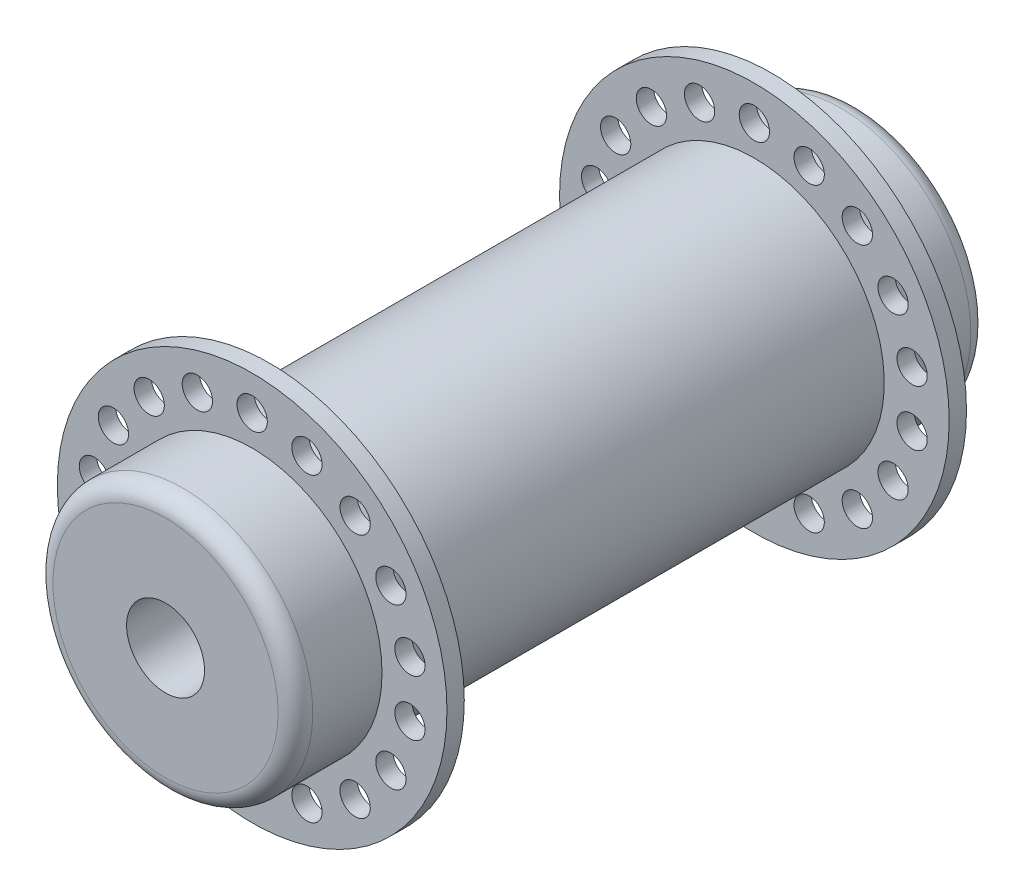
ISO-10303-21;
HEADER;
FILE_DESCRIPTION(('STEP AP214'),'2;1');
FILE_NAME('part.step','',(''),(''),'','','');
FILE_SCHEMA(('AUTOMOTIVE_DESIGN { 1 0 10303 214 1 1 1 1 }'));
ENDSEC;
DATA;
#1=APPLICATION_CONTEXT('core data for automotive mechanical design processes');
#2=APPLICATION_PROTOCOL_DEFINITION('international standard','automotive_design',2000,#1);
#3=PRODUCT_CONTEXT('',#1,'mechanical');
#4=PRODUCT('Part','Part','',(#3));
#5=PRODUCT_RELATED_PRODUCT_CATEGORY('part','',(#4));
#6=PRODUCT_DEFINITION_FORMATION('','',#4);
#7=PRODUCT_DEFINITION_CONTEXT('part definition',#1,'design');
#8=PRODUCT_DEFINITION('design','',#6,#7);
#9=PRODUCT_DEFINITION_SHAPE('','',#8);
#10=(LENGTH_UNIT() NAMED_UNIT(*) SI_UNIT(.MILLI.,.METRE.));
#11=(NAMED_UNIT(*) PLANE_ANGLE_UNIT() SI_UNIT($,.RADIAN.));
#12=(NAMED_UNIT(*) SI_UNIT($,.STERADIAN.) SOLID_ANGLE_UNIT());
#13=UNCERTAINTY_MEASURE_WITH_UNIT(LENGTH_MEASURE(1.E-05),#10,'distance_accuracy_value','');
#14=(GEOMETRIC_REPRESENTATION_CONTEXT(3) GLOBAL_UNCERTAINTY_ASSIGNED_CONTEXT((#13)) GLOBAL_UNIT_ASSIGNED_CONTEXT((#10,
#11,#12)) REPRESENTATION_CONTEXT('',''));
#15=CARTESIAN_POINT('',(0.,0.,0.));
#16=DIRECTION('',(0.,0.,1.));
#17=DIRECTION('',(1.,0.,0.));
#18=AXIS2_PLACEMENT_3D('',#15,#16,#17);
#19=CARTESIAN_POINT('',(0.,0.,-40.));
#20=DIRECTION('',(0.,0.,1.));
#21=DIRECTION('',(1.,0.,0.));
#22=AXIS2_PLACEMENT_3D('',#19,#20,#21);
#23=CYLINDRICAL_SURFACE('',#22,15.);
#24=CARTESIAN_POINT('',(0.,0.,-28.));
#25=DIRECTION('',(0.,0.,-1.));
#26=DIRECTION('',(-1.,0.,0.));
#27=AXIS2_PLACEMENT_3D('',#24,#25,#26);
#28=CIRCLE('',#27,15.);
#29=CARTESIAN_POINT('',(-15.,0.,-28.));
#30=VERTEX_POINT('',#29);
#31=EDGE_CURVE('E165',#30,#30,#28,.T.);
#32=ORIENTED_EDGE('',*,*,#31,.F.);
#33=EDGE_LOOP('',(#32));
#34=FACE_BOUND('',#33,.T.);
#35=CARTESIAN_POINT('',(0.,0.,28.));
#36=DIRECTION('',(0.,0.,-1.));
#37=DIRECTION('',(-1.,0.,0.));
#38=AXIS2_PLACEMENT_3D('',#35,#36,#37);
#39=CIRCLE('',#38,15.);
#40=CARTESIAN_POINT('',(-15.,0.,28.));
#41=VERTEX_POINT('',#40);
#42=EDGE_CURVE('E158',#41,#41,#39,.T.);
#43=ORIENTED_EDGE('',*,*,#42,.T.);
#44=EDGE_LOOP('',(#43));
#45=FACE_BOUND('',#44,.T.);
#46=ADVANCED_FACE('F31',(#34,#45),#23,.T.);
#47=CARTESIAN_POINT('',(0.,0.,30.));
#48=DIRECTION('',(0.,0.,1.));
#49=DIRECTION('',(1.,0.,0.));
#50=AXIS2_PLACEMENT_3D('',#47,#48,#49);
#51=CIRCLE('',#50,15.);
#52=CARTESIAN_POINT('',(15.,0.,30.));
#53=VERTEX_POINT('',#52);
#54=EDGE_CURVE('E10',#53,#53,#51,.F.);
#55=ORIENTED_EDGE('',*,*,#54,.F.);
#56=EDGE_LOOP('',(#55));
#57=FACE_BOUND('',#56,.T.);
#58=CARTESIAN_POINT('',(0.,0.,38.));
#59=DIRECTION('',(0.,0.,1.));
#60=DIRECTION('',(1.,0.,0.));
#61=AXIS2_PLACEMENT_3D('',#58,#59,#60);
#62=CIRCLE('',#61,15.);
#63=CARTESIAN_POINT('',(15.,0.,38.));
#64=VERTEX_POINT('',#63);
#65=EDGE_CURVE('E188',#64,#64,#62,.F.);
#66=ORIENTED_EDGE('',*,*,#65,.T.);
#67=EDGE_LOOP('',(#66));
#68=FACE_BOUND('',#67,.T.);
#69=ADVANCED_FACE('F211',(#57,#68),#23,.T.);
#70=CARTESIAN_POINT('',(0.,0.,-38.));
#71=DIRECTION('',(0.,0.,1.));
#72=DIRECTION('',(1.,0.,0.));
#73=AXIS2_PLACEMENT_3D('',#70,#71,#72);
#74=CIRCLE('',#73,15.);
#75=CARTESIAN_POINT('',(15.,0.,-38.));
#76=VERTEX_POINT('',#75);
#77=EDGE_CURVE('E44',#76,#76,#74,.T.);
#78=ORIENTED_EDGE('',*,*,#77,.T.);
#79=EDGE_LOOP('',(#78));
#80=FACE_BOUND('',#79,.T.);
#81=CARTESIAN_POINT('',(0.,0.,-30.));
#82=DIRECTION('',(0.,0.,-1.));
#83=DIRECTION('',(-1.,0.,0.));
#84=AXIS2_PLACEMENT_3D('',#81,#82,#83);
#85=CIRCLE('',#84,15.);
#86=CARTESIAN_POINT('',(-15.,0.,-30.));
#87=VERTEX_POINT('',#86);
#88=EDGE_CURVE('E182',#87,#87,#85,.F.);
#89=ORIENTED_EDGE('',*,*,#88,.F.);
#90=EDGE_LOOP('',(#89));
#91=FACE_BOUND('',#90,.T.);
#92=ADVANCED_FACE('F193',(#80,#91),#23,.T.);
#93=CARTESIAN_POINT('',(0.,0.,-40.));
#94=DIRECTION('',(0.,0.,1.));
#95=DIRECTION('',(1.,0.,0.));
#96=AXIS2_PLACEMENT_3D('',#93,#94,#95);
#97=PLANE('',#96);
#98=CARTESIAN_POINT('',(0.,0.,-40.));
#99=DIRECTION('',(0.,0.,1.));
#100=DIRECTION('',(1.,0.,0.));
#101=AXIS2_PLACEMENT_3D('',#98,#99,#100);
#102=CIRCLE('',#101,13.);
#103=CARTESIAN_POINT('',(13.,0.,-40.));
#104=VERTEX_POINT('',#103);
#105=EDGE_CURVE('E39',#104,#104,#102,.F.);
#106=ORIENTED_EDGE('',*,*,#105,.T.);
#107=EDGE_LOOP('',(#106));
#108=FACE_BOUND('',#107,.T.);
#109=CARTESIAN_POINT('',(0.,0.,-40.));
#110=DIRECTION('',(0.,0.,1.));
#111=DIRECTION('',(1.,0.,0.));
#112=AXIS2_PLACEMENT_3D('',#109,#110,#111);
#113=CIRCLE('',#112,4.5);
#114=CARTESIAN_POINT('',(4.5,0.,-40.));
#115=VERTEX_POINT('',#114);
#116=EDGE_CURVE('E179',#115,#115,#113,.T.);
#117=ORIENTED_EDGE('',*,*,#116,.T.);
#118=EDGE_LOOP('',(#117));
#119=FACE_BOUND('',#118,.T.);
#120=ADVANCED_FACE('F222',(#108,#119),#97,.F.);
#121=CARTESIAN_POINT('',(0.,0.,-40.));
#122=DIRECTION('',(0.,0.,1.));
#123=DIRECTION('',(1.,0.,0.));
#124=AXIS2_PLACEMENT_3D('',#121,#122,#123);
#125=CYLINDRICAL_SURFACE('',#124,4.5);
#126=ORIENTED_EDGE('',*,*,#116,.F.);
#127=EDGE_LOOP('',(#126));
#128=FACE_BOUND('',#127,.T.);
#129=CARTESIAN_POINT('',(0.,0.,40.));
#130=DIRECTION('',(0.,0.,1.));
#131=DIRECTION('',(1.,0.,0.));
#132=AXIS2_PLACEMENT_3D('',#129,#130,#131);
#133=CIRCLE('',#132,4.5);
#134=CARTESIAN_POINT('',(4.5,0.,40.));
#135=VERTEX_POINT('',#134);
#136=EDGE_CURVE('E174',#135,#135,#133,.T.);
#137=ORIENTED_EDGE('',*,*,#136,.T.);
#138=EDGE_LOOP('',(#137));
#139=FACE_BOUND('',#138,.T.);
#140=ADVANCED_FACE('F226',(#128,#139),#125,.F.);
#141=CARTESIAN_POINT('',(0.,0.,40.));
#142=DIRECTION('',(0.,0.,1.));
#143=DIRECTION('',(1.,0.,0.));
#144=AXIS2_PLACEMENT_3D('',#141,#142,#143);
#145=PLANE('',#144);
#146=CARTESIAN_POINT('',(0.,0.,40.));
#147=DIRECTION('',(0.,0.,1.));
#148=DIRECTION('',(1.,0.,0.));
#149=AXIS2_PLACEMENT_3D('',#146,#147,#148);
#150=CIRCLE('',#149,13.);
#151=CARTESIAN_POINT('',(13.,0.,40.));
#152=VERTEX_POINT('',#151);
#153=EDGE_CURVE('E185',#152,#152,#150,.T.);
#154=ORIENTED_EDGE('',*,*,#153,.T.);
#155=EDGE_LOOP('',(#154));
#156=FACE_BOUND('',#155,.T.);
#157=ORIENTED_EDGE('',*,*,#136,.F.);
#158=EDGE_LOOP('',(#157));
#159=FACE_BOUND('',#158,.T.);
#160=ADVANCED_FACE('F231',(#156,#159),#145,.T.);
#161=CARTESIAN_POINT('',(0.,0.,-30.));
#162=DIRECTION('',(0.,0.,-1.));
#163=DIRECTION('',(-1.,0.,0.));
#164=AXIS2_PLACEMENT_3D('',#161,#162,#163);
#165=PLANE('',#164);
#166=CARTESIAN_POINT('',(6.32737265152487,-17.3843134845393,-30.));
#167=DIRECTION('',(0.,0.,-1.));
#168=DIRECTION('',(-1.,0.,0.));
#169=AXIS2_PLACEMENT_3D('',#166,#167,#168);
#170=CIRCLE('',#169,1.75);
#171=CARTESIAN_POINT('',(4.57737265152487,-17.3843134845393,-30.));
#172=VERTEX_POINT('',#171);
#173=EDGE_CURVE('E155',#172,#172,#170,.T.);
#174=ORIENTED_EDGE('',*,*,#173,.F.);
#175=EDGE_LOOP('',(#174));
#176=FACE_BOUND('',#175,.T.);
#177=CARTESIAN_POINT('',(11.891570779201,-14.1718221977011,-30.));
#178=DIRECTION('',(0.,0.,-1.));
#179=DIRECTION('',(-1.,0.,0.));
#180=AXIS2_PLACEMENT_3D('',#177,#178,#179);
#181=CIRCLE('',#180,1.75);
#182=CARTESIAN_POINT('',(10.141570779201,-14.1718221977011,-30.));
#183=VERTEX_POINT('',#182);
#184=EDGE_CURVE('E146',#183,#183,#181,.T.);
#185=ORIENTED_EDGE('',*,*,#184,.F.);
#186=EDGE_LOOP('',(#185));
#187=FACE_BOUND('',#186,.T.);
#188=CARTESIAN_POINT('',(16.0214699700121,-9.25,-30.));
#189=DIRECTION('',(0.,0.,-1.));
#190=DIRECTION('',(-1.,0.,0.));
#191=AXIS2_PLACEMENT_3D('',#188,#189,#190);
#192=CIRCLE('',#191,1.75);
#193=CARTESIAN_POINT('',(14.2714699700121,-9.25,-30.));
#194=VERTEX_POINT('',#193);
#195=EDGE_CURVE('E129',#194,#194,#192,.T.);
#196=ORIENTED_EDGE('',*,*,#195,.F.);
#197=EDGE_LOOP('',(#196));
#198=FACE_BOUND('',#197,.T.);
#199=CARTESIAN_POINT('',(18.2189434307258,-3.21249128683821,-30.));
#200=DIRECTION('',(0.,0.,-1.));
#201=DIRECTION('',(-1.,0.,0.));
#202=AXIS2_PLACEMENT_3D('',#199,#200,#201);
#203=CIRCLE('',#202,1.75);
#204=CARTESIAN_POINT('',(16.4689434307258,-3.21249128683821,-30.));
#205=VERTEX_POINT('',#204);
#206=EDGE_CURVE('E125',#205,#205,#203,.T.);
#207=ORIENTED_EDGE('',*,*,#206,.F.);
#208=EDGE_LOOP('',(#207));
#209=FACE_BOUND('',#208,.T.);
#210=CARTESIAN_POINT('',(18.2189434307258,3.21249128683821,-30.));
#211=DIRECTION('',(0.,0.,-1.));
#212=DIRECTION('',(-1.,0.,0.));
#213=AXIS2_PLACEMENT_3D('',#210,#211,#212);
#214=CIRCLE('',#213,1.75);
#215=CARTESIAN_POINT('',(16.4689434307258,3.21249128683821,-30.));
#216=VERTEX_POINT('',#215);
#217=EDGE_CURVE('E121',#216,#216,#214,.T.);
#218=ORIENTED_EDGE('',*,*,#217,.F.);
#219=EDGE_LOOP('',(#218));
#220=FACE_BOUND('',#219,.T.);
#221=CARTESIAN_POINT('',(16.0214699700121,9.25,-30.));
#222=DIRECTION('',(0.,0.,-1.));
#223=DIRECTION('',(-1.,0.,0.));
#224=AXIS2_PLACEMENT_3D('',#221,#222,#223);
#225=CIRCLE('',#224,1.75);
#226=CARTESIAN_POINT('',(14.2714699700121,9.25,-30.));
#227=VERTEX_POINT('',#226);
#228=EDGE_CURVE('E116',#227,#227,#225,.T.);
#229=ORIENTED_EDGE('',*,*,#228,.F.);
#230=EDGE_LOOP('',(#229));
#231=FACE_BOUND('',#230,.T.);
#232=CARTESIAN_POINT('',(11.891570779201,14.1718221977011,-30.));
#233=DIRECTION('',(0.,0.,-1.));
#234=DIRECTION('',(-1.,0.,0.));
#235=AXIS2_PLACEMENT_3D('',#232,#233,#234);
#236=CIRCLE('',#235,1.75);
#237=CARTESIAN_POINT('',(10.141570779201,14.1718221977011,-30.));
#238=VERTEX_POINT('',#237);
#239=EDGE_CURVE('E111',#238,#238,#236,.T.);
#240=ORIENTED_EDGE('',*,*,#239,.F.);
#241=EDGE_LOOP('',(#240));
#242=FACE_BOUND('',#241,.T.);
#243=CARTESIAN_POINT('',(6.32737265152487,17.3843134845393,-30.));
#244=DIRECTION('',(0.,0.,-1.));
#245=DIRECTION('',(-1.,0.,0.));
#246=AXIS2_PLACEMENT_3D('',#243,#244,#245);
#247=CIRCLE('',#246,1.75);
#248=CARTESIAN_POINT('',(4.57737265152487,17.3843134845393,-30.));
#249=VERTEX_POINT('',#248);
#250=EDGE_CURVE('E106',#249,#249,#247,.T.);
#251=ORIENTED_EDGE('',*,*,#250,.F.);
#252=EDGE_LOOP('',(#251));
#253=FACE_BOUND('',#252,.T.);
#254=CARTESIAN_POINT('',(0.,18.5,-30.));
#255=DIRECTION('',(0.,0.,-1.));
#256=DIRECTION('',(-1.,0.,0.));
#257=AXIS2_PLACEMENT_3D('',#254,#255,#256);
#258=CIRCLE('',#257,1.75);
#259=CARTESIAN_POINT('',(-1.75,18.5,-30.));
#260=VERTEX_POINT('',#259);
#261=EDGE_CURVE('E101',#260,#260,#258,.T.);
#262=ORIENTED_EDGE('',*,*,#261,.F.);
#263=EDGE_LOOP('',(#262));
#264=FACE_BOUND('',#263,.T.);
#265=CARTESIAN_POINT('',(-6.32737265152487,17.3843134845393,-30.));
#266=DIRECTION('',(0.,0.,-1.));
#267=DIRECTION('',(-1.,0.,0.));
#268=AXIS2_PLACEMENT_3D('',#265,#266,#267);
#269=CIRCLE('',#268,1.75);
#270=CARTESIAN_POINT('',(-8.07737265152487,17.3843134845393,-30.));
#271=VERTEX_POINT('',#270);
#272=EDGE_CURVE('E96',#271,#271,#269,.T.);
#273=ORIENTED_EDGE('',*,*,#272,.F.);
#274=EDGE_LOOP('',(#273));
#275=FACE_BOUND('',#274,.T.);
#276=CARTESIAN_POINT('',(-11.891570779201,14.1718221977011,-30.));
#277=DIRECTION('',(0.,0.,-1.));
#278=DIRECTION('',(-1.,0.,0.));
#279=AXIS2_PLACEMENT_3D('',#276,#277,#278);
#280=CIRCLE('',#279,1.75);
#281=CARTESIAN_POINT('',(-13.641570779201,14.1718221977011,-30.));
#282=VERTEX_POINT('',#281);
#283=EDGE_CURVE('E91',#282,#282,#280,.T.);
#284=ORIENTED_EDGE('',*,*,#283,.F.);
#285=EDGE_LOOP('',(#284));
#286=FACE_BOUND('',#285,.T.);
#287=CARTESIAN_POINT('',(-16.0214699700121,9.25000000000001,-30.));
#288=DIRECTION('',(0.,0.,-1.));
#289=DIRECTION('',(-1.,0.,0.));
#290=AXIS2_PLACEMENT_3D('',#287,#288,#289);
#291=CIRCLE('',#290,1.75);
#292=CARTESIAN_POINT('',(-17.7714699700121,9.25000000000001,-30.));
#293=VERTEX_POINT('',#292);
#294=EDGE_CURVE('E86',#293,#293,#291,.T.);
#295=ORIENTED_EDGE('',*,*,#294,.F.);
#296=EDGE_LOOP('',(#295));
#297=FACE_BOUND('',#296,.T.);
#298=CARTESIAN_POINT('',(-18.2189434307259,3.21249128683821,-30.));
#299=DIRECTION('',(0.,0.,-1.));
#300=DIRECTION('',(-1.,0.,0.));
#301=AXIS2_PLACEMENT_3D('',#298,#299,#300);
#302=CIRCLE('',#301,1.75);
#303=CARTESIAN_POINT('',(-19.9689434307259,3.21249128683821,-30.));
#304=VERTEX_POINT('',#303);
#305=EDGE_CURVE('E81',#304,#304,#302,.T.);
#306=ORIENTED_EDGE('',*,*,#305,.F.);
#307=EDGE_LOOP('',(#306));
#308=FACE_BOUND('',#307,.T.);
#309=CARTESIAN_POINT('',(-18.2189434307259,-3.21249128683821,-30.));
#310=DIRECTION('',(0.,0.,-1.));
#311=DIRECTION('',(-1.,0.,0.));
#312=AXIS2_PLACEMENT_3D('',#309,#310,#311);
#313=CIRCLE('',#312,1.75);
#314=CARTESIAN_POINT('',(-19.9689434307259,-3.21249128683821,-30.));
#315=VERTEX_POINT('',#314);
#316=EDGE_CURVE('E76',#315,#315,#313,.T.);
#317=ORIENTED_EDGE('',*,*,#316,.F.);
#318=EDGE_LOOP('',(#317));
#319=FACE_BOUND('',#318,.T.);
#320=CARTESIAN_POINT('',(-16.0214699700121,-9.25,-30.));
#321=DIRECTION('',(0.,0.,-1.));
#322=DIRECTION('',(-1.,0.,0.));
#323=AXIS2_PLACEMENT_3D('',#320,#321,#322);
#324=CIRCLE('',#323,1.75);
#325=CARTESIAN_POINT('',(-17.7714699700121,-9.25,-30.));
#326=VERTEX_POINT('',#325);
#327=EDGE_CURVE('E71',#326,#326,#324,.T.);
#328=ORIENTED_EDGE('',*,*,#327,.F.);
#329=EDGE_LOOP('',(#328));
#330=FACE_BOUND('',#329,.T.);
#331=CARTESIAN_POINT('',(-11.891570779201,-14.1718221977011,-30.));
#332=DIRECTION('',(0.,0.,-1.));
#333=DIRECTION('',(-1.,0.,0.));
#334=AXIS2_PLACEMENT_3D('',#331,#332,#333);
#335=CIRCLE('',#334,1.75);
#336=CARTESIAN_POINT('',(-13.641570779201,-14.1718221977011,-30.));
#337=VERTEX_POINT('',#336);
#338=EDGE_CURVE('E66',#337,#337,#335,.T.);
#339=ORIENTED_EDGE('',*,*,#338,.F.);
#340=EDGE_LOOP('',(#339));
#341=FACE_BOUND('',#340,.T.);
#342=CARTESIAN_POINT('',(-6.32737265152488,-17.3843134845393,-30.));
#343=DIRECTION('',(0.,0.,-1.));
#344=DIRECTION('',(-1.,0.,0.));
#345=AXIS2_PLACEMENT_3D('',#342,#343,#344);
#346=CIRCLE('',#345,1.75);
#347=CARTESIAN_POINT('',(-8.07737265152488,-17.3843134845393,-30.));
#348=VERTEX_POINT('',#347);
#349=EDGE_CURVE('E61',#348,#348,#346,.T.);
#350=ORIENTED_EDGE('',*,*,#349,.F.);
#351=EDGE_LOOP('',(#350));
#352=FACE_BOUND('',#351,.T.);
#353=CARTESIAN_POINT('',(0.,-18.5,-30.));
#354=DIRECTION('',(0.,0.,-1.));
#355=DIRECTION('',(-1.,0.,0.));
#356=AXIS2_PLACEMENT_3D('',#353,#354,#355);
#357=CIRCLE('',#356,1.75);
#358=CARTESIAN_POINT('',(-1.75,-18.5,-30.));
#359=VERTEX_POINT('',#358);
#360=EDGE_CURVE('E56',#359,#359,#357,.T.);
#361=ORIENTED_EDGE('',*,*,#360,.F.);
#362=EDGE_LOOP('',(#361));
#363=FACE_BOUND('',#362,.T.);
#364=CARTESIAN_POINT('',(0.,0.,-30.));
#365=DIRECTION('',(0.,0.,-1.));
#366=DIRECTION('',(-1.,0.,0.));
#367=AXIS2_PLACEMENT_3D('',#364,#365,#366);
#368=CIRCLE('',#367,22.5);
#369=CARTESIAN_POINT('',(-22.5,0.,-30.));
#370=VERTEX_POINT('',#369);
#371=EDGE_CURVE('E171',#370,#370,#368,.T.);
#372=ORIENTED_EDGE('',*,*,#371,.T.);
#373=EDGE_LOOP('',(#372));
#374=FACE_BOUND('',#373,.T.);
#375=ORIENTED_EDGE('',*,*,#88,.T.);
#376=EDGE_LOOP('',(#375));
#377=FACE_BOUND('',#376,.T.);
#378=ADVANCED_FACE('F238',(#176,#187,#198,#209,#220,#231,#242,#253,#264,#275,#286,#297,#308,
#319,#330,#341,#352,#363,#374,#377),#165,.T.);
#379=CARTESIAN_POINT('',(0.,0.,-28.));
#380=DIRECTION('',(0.,0.,-1.));
#381=DIRECTION('',(-1.,0.,0.));
#382=AXIS2_PLACEMENT_3D('',#379,#380,#381);
#383=PLANE('',#382);
#384=CARTESIAN_POINT('',(6.32737265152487,-17.3843134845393,-28.));
#385=DIRECTION('',(0.,0.,-1.));
#386=DIRECTION('',(-1.,0.,0.));
#387=AXIS2_PLACEMENT_3D('',#384,#385,#386);
#388=CIRCLE('',#387,1.75);
#389=CARTESIAN_POINT('',(4.57737265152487,-17.3843134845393,-28.));
#390=VERTEX_POINT('',#389);
#391=EDGE_CURVE('E152',#390,#390,#388,.T.);
#392=ORIENTED_EDGE('',*,*,#391,.T.);
#393=EDGE_LOOP('',(#392));
#394=FACE_BOUND('',#393,.T.);
#395=CARTESIAN_POINT('',(11.891570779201,-14.1718221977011,-28.));
#396=DIRECTION('',(0.,0.,-1.));
#397=DIRECTION('',(-1.,0.,0.));
#398=AXIS2_PLACEMENT_3D('',#395,#396,#397);
#399=CIRCLE('',#398,1.75);
#400=CARTESIAN_POINT('',(10.141570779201,-14.1718221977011,-28.));
#401=VERTEX_POINT('',#400);
#402=EDGE_CURVE('E133',#401,#401,#399,.T.);
#403=ORIENTED_EDGE('',*,*,#402,.T.);
#404=EDGE_LOOP('',(#403));
#405=FACE_BOUND('',#404,.T.);
#406=CARTESIAN_POINT('',(16.0214699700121,-9.25,-28.));
#407=DIRECTION('',(0.,0.,-1.));
#408=DIRECTION('',(-1.,0.,0.));
#409=AXIS2_PLACEMENT_3D('',#406,#407,#408);
#410=CIRCLE('',#409,1.75);
#411=CARTESIAN_POINT('',(14.2714699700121,-9.25,-28.));
#412=VERTEX_POINT('',#411);
#413=EDGE_CURVE('E136',#412,#412,#410,.T.);
#414=ORIENTED_EDGE('',*,*,#413,.T.);
#415=EDGE_LOOP('',(#414));
#416=FACE_BOUND('',#415,.T.);
#417=CARTESIAN_POINT('',(18.2189434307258,-3.21249128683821,-28.));
#418=DIRECTION('',(0.,0.,-1.));
#419=DIRECTION('',(-1.,0.,0.));
#420=AXIS2_PLACEMENT_3D('',#417,#418,#419);
#421=CIRCLE('',#420,1.75);
#422=CARTESIAN_POINT('',(16.4689434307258,-3.21249128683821,-28.));
#423=VERTEX_POINT('',#422);
#424=EDGE_CURVE('E465',#423,#423,#421,.T.);
#425=ORIENTED_EDGE('',*,*,#424,.T.);
#426=EDGE_LOOP('',(#425));
#427=FACE_BOUND('',#426,.T.);
#428=CARTESIAN_POINT('',(18.2189434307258,3.21249128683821,-28.));
#429=DIRECTION('',(0.,0.,-1.));
#430=DIRECTION('',(-1.,0.,0.));
#431=AXIS2_PLACEMENT_3D('',#428,#429,#430);
#432=CIRCLE('',#431,1.75);
#433=CARTESIAN_POINT('',(16.4689434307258,3.21249128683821,-28.));
#434=VERTEX_POINT('',#433);
#435=EDGE_CURVE('E458',#434,#434,#432,.T.);
#436=ORIENTED_EDGE('',*,*,#435,.T.);
#437=EDGE_LOOP('',(#436));
#438=FACE_BOUND('',#437,.T.);
#439=CARTESIAN_POINT('',(16.0214699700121,9.25,-28.));
#440=DIRECTION('',(0.,0.,-1.));
#441=DIRECTION('',(-1.,0.,0.));
#442=AXIS2_PLACEMENT_3D('',#439,#440,#441);
#443=CIRCLE('',#442,1.75);
#444=CARTESIAN_POINT('',(14.2714699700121,9.25,-28.));
#445=VERTEX_POINT('',#444);
#446=EDGE_CURVE('E451',#445,#445,#443,.T.);
#447=ORIENTED_EDGE('',*,*,#446,.T.);
#448=EDGE_LOOP('',(#447));
#449=FACE_BOUND('',#448,.T.);
#450=CARTESIAN_POINT('',(11.891570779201,14.1718221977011,-28.));
#451=DIRECTION('',(0.,0.,-1.));
#452=DIRECTION('',(-1.,0.,0.));
#453=AXIS2_PLACEMENT_3D('',#450,#451,#452);
#454=CIRCLE('',#453,1.75);
#455=CARTESIAN_POINT('',(10.141570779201,14.1718221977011,-28.));
#456=VERTEX_POINT('',#455);
#457=EDGE_CURVE('E444',#456,#456,#454,.T.);
#458=ORIENTED_EDGE('',*,*,#457,.T.);
#459=EDGE_LOOP('',(#458));
#460=FACE_BOUND('',#459,.T.);
#461=CARTESIAN_POINT('',(6.32737265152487,17.3843134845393,-28.));
#462=DIRECTION('',(0.,0.,-1.));
#463=DIRECTION('',(-1.,0.,0.));
#464=AXIS2_PLACEMENT_3D('',#461,#462,#463);
#465=CIRCLE('',#464,1.75);
#466=CARTESIAN_POINT('',(4.57737265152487,17.3843134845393,-28.));
#467=VERTEX_POINT('',#466);
#468=EDGE_CURVE('E437',#467,#467,#465,.T.);
#469=ORIENTED_EDGE('',*,*,#468,.T.);
#470=EDGE_LOOP('',(#469));
#471=FACE_BOUND('',#470,.T.);
#472=CARTESIAN_POINT('',(0.,18.5,-28.));
#473=DIRECTION('',(0.,0.,-1.));
#474=DIRECTION('',(-1.,0.,0.));
#475=AXIS2_PLACEMENT_3D('',#472,#473,#474);
#476=CIRCLE('',#475,1.75);
#477=CARTESIAN_POINT('',(-1.75,18.5,-28.));
#478=VERTEX_POINT('',#477);
#479=EDGE_CURVE('E430',#478,#478,#476,.T.);
#480=ORIENTED_EDGE('',*,*,#479,.T.);
#481=EDGE_LOOP('',(#480));
#482=FACE_BOUND('',#481,.T.);
#483=CARTESIAN_POINT('',(-6.32737265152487,17.3843134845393,-28.));
#484=DIRECTION('',(0.,0.,-1.));
#485=DIRECTION('',(-1.,0.,0.));
#486=AXIS2_PLACEMENT_3D('',#483,#484,#485);
#487=CIRCLE('',#486,1.75);
#488=CARTESIAN_POINT('',(-8.07737265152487,17.3843134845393,-28.));
#489=VERTEX_POINT('',#488);
#490=EDGE_CURVE('E423',#489,#489,#487,.T.);
#491=ORIENTED_EDGE('',*,*,#490,.T.);
#492=EDGE_LOOP('',(#491));
#493=FACE_BOUND('',#492,.T.);
#494=CARTESIAN_POINT('',(-11.891570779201,14.1718221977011,-28.));
#495=DIRECTION('',(0.,0.,-1.));
#496=DIRECTION('',(-1.,0.,0.));
#497=AXIS2_PLACEMENT_3D('',#494,#495,#496);
#498=CIRCLE('',#497,1.75);
#499=CARTESIAN_POINT('',(-13.641570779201,14.1718221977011,-28.));
#500=VERTEX_POINT('',#499);
#501=EDGE_CURVE('E416',#500,#500,#498,.T.);
#502=ORIENTED_EDGE('',*,*,#501,.T.);
#503=EDGE_LOOP('',(#502));
#504=FACE_BOUND('',#503,.T.);
#505=CARTESIAN_POINT('',(-16.0214699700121,9.25000000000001,-28.));
#506=DIRECTION('',(0.,0.,-1.));
#507=DIRECTION('',(-1.,0.,0.));
#508=AXIS2_PLACEMENT_3D('',#505,#506,#507);
#509=CIRCLE('',#508,1.75);
#510=CARTESIAN_POINT('',(-17.7714699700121,9.25000000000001,-28.));
#511=VERTEX_POINT('',#510);
#512=EDGE_CURVE('E409',#511,#511,#509,.T.);
#513=ORIENTED_EDGE('',*,*,#512,.T.);
#514=EDGE_LOOP('',(#513));
#515=FACE_BOUND('',#514,.T.);
#516=CARTESIAN_POINT('',(-18.2189434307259,3.21249128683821,-28.));
#517=DIRECTION('',(0.,0.,-1.));
#518=DIRECTION('',(-1.,0.,0.));
#519=AXIS2_PLACEMENT_3D('',#516,#517,#518);
#520=CIRCLE('',#519,1.75);
#521=CARTESIAN_POINT('',(-19.9689434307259,3.21249128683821,-28.));
#522=VERTEX_POINT('',#521);
#523=EDGE_CURVE('E402',#522,#522,#520,.T.);
#524=ORIENTED_EDGE('',*,*,#523,.T.);
#525=EDGE_LOOP('',(#524));
#526=FACE_BOUND('',#525,.T.);
#527=CARTESIAN_POINT('',(-18.2189434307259,-3.21249128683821,-28.));
#528=DIRECTION('',(0.,0.,-1.));
#529=DIRECTION('',(-1.,0.,0.));
#530=AXIS2_PLACEMENT_3D('',#527,#528,#529);
#531=CIRCLE('',#530,1.75);
#532=CARTESIAN_POINT('',(-19.9689434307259,-3.21249128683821,-28.));
#533=VERTEX_POINT('',#532);
#534=EDGE_CURVE('E395',#533,#533,#531,.T.);
#535=ORIENTED_EDGE('',*,*,#534,.T.);
#536=EDGE_LOOP('',(#535));
#537=FACE_BOUND('',#536,.T.);
#538=CARTESIAN_POINT('',(-16.0214699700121,-9.25,-28.));
#539=DIRECTION('',(0.,0.,-1.));
#540=DIRECTION('',(-1.,0.,0.));
#541=AXIS2_PLACEMENT_3D('',#538,#539,#540);
#542=CIRCLE('',#541,1.75);
#543=CARTESIAN_POINT('',(-17.7714699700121,-9.25,-28.));
#544=VERTEX_POINT('',#543);
#545=EDGE_CURVE('E388',#544,#544,#542,.T.);
#546=ORIENTED_EDGE('',*,*,#545,.T.);
#547=EDGE_LOOP('',(#546));
#548=FACE_BOUND('',#547,.T.);
#549=CARTESIAN_POINT('',(-11.891570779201,-14.1718221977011,-28.));
#550=DIRECTION('',(0.,0.,-1.));
#551=DIRECTION('',(-1.,0.,0.));
#552=AXIS2_PLACEMENT_3D('',#549,#550,#551);
#553=CIRCLE('',#552,1.75);
#554=CARTESIAN_POINT('',(-13.641570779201,-14.1718221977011,-28.));
#555=VERTEX_POINT('',#554);
#556=EDGE_CURVE('E381',#555,#555,#553,.T.);
#557=ORIENTED_EDGE('',*,*,#556,.T.);
#558=EDGE_LOOP('',(#557));
#559=FACE_BOUND('',#558,.T.);
#560=CARTESIAN_POINT('',(-6.32737265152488,-17.3843134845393,-28.));
#561=DIRECTION('',(0.,0.,-1.));
#562=DIRECTION('',(-1.,0.,0.));
#563=AXIS2_PLACEMENT_3D('',#560,#561,#562);
#564=CIRCLE('',#563,1.75);
#565=CARTESIAN_POINT('',(-8.07737265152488,-17.3843134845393,-28.));
#566=VERTEX_POINT('',#565);
#567=EDGE_CURVE('E371',#566,#566,#564,.T.);
#568=ORIENTED_EDGE('',*,*,#567,.T.);
#569=EDGE_LOOP('',(#568));
#570=FACE_BOUND('',#569,.T.);
#571=CARTESIAN_POINT('',(0.,-18.5,-28.));
#572=DIRECTION('',(0.,0.,-1.));
#573=DIRECTION('',(-1.,0.,0.));
#574=AXIS2_PLACEMENT_3D('',#571,#572,#573);
#575=CIRCLE('',#574,1.75);
#576=CARTESIAN_POINT('',(-1.75,-18.5,-28.));
#577=VERTEX_POINT('',#576);
#578=EDGE_CURVE('E505',#577,#577,#575,.T.);
#579=ORIENTED_EDGE('',*,*,#578,.T.);
#580=EDGE_LOOP('',(#579));
#581=FACE_BOUND('',#580,.T.);
#582=CARTESIAN_POINT('',(0.,0.,-28.));
#583=DIRECTION('',(0.,0.,-1.));
#584=DIRECTION('',(-1.,0.,0.));
#585=AXIS2_PLACEMENT_3D('',#582,#583,#584);
#586=CIRCLE('',#585,22.5);
#587=CARTESIAN_POINT('',(-22.5,0.,-28.));
#588=VERTEX_POINT('',#587);
#589=EDGE_CURVE('E170',#588,#588,#586,.T.);
#590=ORIENTED_EDGE('',*,*,#589,.F.);
#591=EDGE_LOOP('',(#590));
#592=FACE_BOUND('',#591,.T.);
#593=ORIENTED_EDGE('',*,*,#31,.T.);
#594=EDGE_LOOP('',(#593));
#595=FACE_BOUND('',#594,.T.);
#596=ADVANCED_FACE('F242',(#394,#405,#416,#427,#438,#449,#460,#471,#482,#493,#504,#515,#526,
#537,#548,#559,#570,#581,#592,#595),#383,.F.);
#597=CARTESIAN_POINT('',(0.,0.,-30.));
#598=DIRECTION('',(0.,0.,1.));
#599=DIRECTION('',(1.,0.,0.));
#600=AXIS2_PLACEMENT_3D('',#597,#598,#599);
#601=CYLINDRICAL_SURFACE('',#600,22.5);
#602=ORIENTED_EDGE('',*,*,#371,.F.);
#603=EDGE_LOOP('',(#602));
#604=FACE_BOUND('',#603,.T.);
#605=ORIENTED_EDGE('',*,*,#589,.T.);
#606=EDGE_LOOP('',(#605));
#607=FACE_BOUND('',#606,.T.);
#608=ADVANCED_FACE('F207',(#604,#607),#601,.T.);
#609=CARTESIAN_POINT('',(0.,0.,38.));
#610=DIRECTION('',(0.,0.,1.));
#611=DIRECTION('',(1.,0.,0.));
#612=AXIS2_PLACEMENT_3D('',#609,#610,#611);
#613=TOROIDAL_SURFACE('',#612,13.,2.);
#614=ORIENTED_EDGE('',*,*,#65,.F.);
#615=EDGE_LOOP('',(#614));
#616=FACE_BOUND('',#615,.T.);
#617=ORIENTED_EDGE('',*,*,#153,.F.);
#618=EDGE_LOOP('',(#617));
#619=FACE_BOUND('',#618,.T.);
#620=ADVANCED_FACE('F198',(#616,#619),#613,.T.);
#621=CARTESIAN_POINT('',(0.,0.,-38.));
#622=DIRECTION('',(0.,0.,1.));
#623=DIRECTION('',(1.,0.,0.));
#624=AXIS2_PLACEMENT_3D('',#621,#622,#623);
#625=TOROIDAL_SURFACE('',#624,13.,2.);
#626=ORIENTED_EDGE('',*,*,#105,.F.);
#627=EDGE_LOOP('',(#626));
#628=FACE_BOUND('',#627,.T.);
#629=ORIENTED_EDGE('',*,*,#77,.F.);
#630=EDGE_LOOP('',(#629));
#631=FACE_BOUND('',#630,.T.);
#632=ADVANCED_FACE('F33',(#628,#631),#625,.T.);
#633=CARTESIAN_POINT('',(0.,0.,30.));
#634=DIRECTION('',(0.,0.,-1.));
#635=DIRECTION('',(-1.,0.,0.));
#636=AXIS2_PLACEMENT_3D('',#633,#634,#635);
#637=CYLINDRICAL_SURFACE('',#636,22.5);
#638=CARTESIAN_POINT('',(0.,0.,30.));
#639=DIRECTION('',(0.,0.,-1.));
#640=DIRECTION('',(-1.,0.,0.));
#641=AXIS2_PLACEMENT_3D('',#638,#639,#640);
#642=CIRCLE('',#641,22.5);
#643=CARTESIAN_POINT('',(-22.5,0.,30.));
#644=VERTEX_POINT('',#643);
#645=EDGE_CURVE('E162',#644,#644,#642,.T.);
#646=ORIENTED_EDGE('',*,*,#645,.T.);
#647=EDGE_LOOP('',(#646));
#648=FACE_BOUND('',#647,.T.);
#649=CARTESIAN_POINT('',(0.,0.,28.));
#650=DIRECTION('',(0.,0.,-1.));
#651=DIRECTION('',(-1.,0.,0.));
#652=AXIS2_PLACEMENT_3D('',#649,#650,#651);
#653=CIRCLE('',#652,22.5);
#654=CARTESIAN_POINT('',(-22.5,0.,28.));
#655=VERTEX_POINT('',#654);
#656=EDGE_CURVE('E161',#655,#655,#653,.T.);
#657=ORIENTED_EDGE('',*,*,#656,.F.);
#658=EDGE_LOOP('',(#657));
#659=FACE_BOUND('',#658,.T.);
#660=ADVANCED_FACE('F197',(#648,#659),#637,.T.);
#661=CARTESIAN_POINT('',(0.,0.,30.));
#662=DIRECTION('',(0.,0.,1.));
#663=DIRECTION('',(-1.,0.,0.));
#664=AXIS2_PLACEMENT_3D('',#661,#662,#663);
#665=PLANE('',#664);
#666=CARTESIAN_POINT('',(6.32737265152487,-17.3843134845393,30.));
#667=DIRECTION('',(0.,0.,1.));
#668=DIRECTION('',(1.,0.,0.));
#669=AXIS2_PLACEMENT_3D('',#666,#667,#668);
#670=CIRCLE('',#669,1.75);
#671=CARTESIAN_POINT('',(8.07737265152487,-17.3843134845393,30.));
#672=VERTEX_POINT('',#671);
#673=EDGE_CURVE('E149',#672,#672,#670,.T.);
#674=ORIENTED_EDGE('',*,*,#673,.F.);
#675=EDGE_LOOP('',(#674));
#676=FACE_BOUND('',#675,.T.);
#677=CARTESIAN_POINT('',(11.891570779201,-14.1718221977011,30.));
#678=DIRECTION('',(0.,0.,1.));
#679=DIRECTION('',(1.,0.,0.));
#680=AXIS2_PLACEMENT_3D('',#677,#678,#679);
#681=CIRCLE('',#680,1.75);
#682=CARTESIAN_POINT('',(13.641570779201,-14.1718221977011,30.));
#683=VERTEX_POINT('',#682);
#684=EDGE_CURVE('E128',#683,#683,#681,.T.);
#685=ORIENTED_EDGE('',*,*,#684,.F.);
#686=EDGE_LOOP('',(#685));
#687=FACE_BOUND('',#686,.T.);
#688=CARTESIAN_POINT('',(16.0214699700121,-9.25,30.));
#689=DIRECTION('',(0.,0.,1.));
#690=DIRECTION('',(1.,0.,0.));
#691=AXIS2_PLACEMENT_3D('',#688,#689,#690);
#692=CIRCLE('',#691,1.75);
#693=CARTESIAN_POINT('',(17.7714699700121,-9.25,30.));
#694=VERTEX_POINT('',#693);
#695=EDGE_CURVE('E124',#694,#694,#692,.T.);
#696=ORIENTED_EDGE('',*,*,#695,.F.);
#697=EDGE_LOOP('',(#696));
#698=FACE_BOUND('',#697,.T.);
#699=CARTESIAN_POINT('',(18.2189434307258,-3.21249128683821,30.));
#700=DIRECTION('',(0.,0.,1.));
#701=DIRECTION('',(1.,0.,0.));
#702=AXIS2_PLACEMENT_3D('',#699,#700,#701);
#703=CIRCLE('',#702,1.75);
#704=CARTESIAN_POINT('',(19.9689434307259,-3.21249128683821,30.));
#705=VERTEX_POINT('',#704);
#706=EDGE_CURVE('E120',#705,#705,#703,.T.);
#707=ORIENTED_EDGE('',*,*,#706,.F.);
#708=EDGE_LOOP('',(#707));
#709=FACE_BOUND('',#708,.T.);
#710=CARTESIAN_POINT('',(18.2189434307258,3.21249128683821,30.));
#711=DIRECTION('',(0.,0.,1.));
#712=DIRECTION('',(1.,0.,0.));
#713=AXIS2_PLACEMENT_3D('',#710,#711,#712);
#714=CIRCLE('',#713,1.75);
#715=CARTESIAN_POINT('',(19.9689434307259,3.21249128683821,30.));
#716=VERTEX_POINT('',#715);
#717=EDGE_CURVE('E115',#716,#716,#714,.T.);
#718=ORIENTED_EDGE('',*,*,#717,.F.);
#719=EDGE_LOOP('',(#718));
#720=FACE_BOUND('',#719,.T.);
#721=CARTESIAN_POINT('',(16.0214699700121,9.25,30.));
#722=DIRECTION('',(0.,0.,1.));
#723=DIRECTION('',(1.,0.,0.));
#724=AXIS2_PLACEMENT_3D('',#721,#722,#723);
#725=CIRCLE('',#724,1.75);
#726=CARTESIAN_POINT('',(17.7714699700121,9.25,30.));
#727=VERTEX_POINT('',#726);
#728=EDGE_CURVE('E110',#727,#727,#725,.T.);
#729=ORIENTED_EDGE('',*,*,#728,.F.);
#730=EDGE_LOOP('',(#729));
#731=FACE_BOUND('',#730,.T.);
#732=CARTESIAN_POINT('',(11.891570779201,14.1718221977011,30.));
#733=DIRECTION('',(0.,0.,1.));
#734=DIRECTION('',(1.,0.,0.));
#735=AXIS2_PLACEMENT_3D('',#732,#733,#734);
#736=CIRCLE('',#735,1.75);
#737=CARTESIAN_POINT('',(13.641570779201,14.1718221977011,30.));
#738=VERTEX_POINT('',#737);
#739=EDGE_CURVE('E105',#738,#738,#736,.T.);
#740=ORIENTED_EDGE('',*,*,#739,.F.);
#741=EDGE_LOOP('',(#740));
#742=FACE_BOUND('',#741,.T.);
#743=CARTESIAN_POINT('',(6.32737265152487,17.3843134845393,30.));
#744=DIRECTION('',(0.,0.,1.));
#745=DIRECTION('',(1.,0.,0.));
#746=AXIS2_PLACEMENT_3D('',#743,#744,#745);
#747=CIRCLE('',#746,1.75);
#748=CARTESIAN_POINT('',(8.07737265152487,17.3843134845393,30.));
#749=VERTEX_POINT('',#748);
#750=EDGE_CURVE('E100',#749,#749,#747,.T.);
#751=ORIENTED_EDGE('',*,*,#750,.F.);
#752=EDGE_LOOP('',(#751));
#753=FACE_BOUND('',#752,.T.);
#754=CARTESIAN_POINT('',(0.,18.5,30.));
#755=DIRECTION('',(0.,0.,1.));
#756=DIRECTION('',(1.,0.,0.));
#757=AXIS2_PLACEMENT_3D('',#754,#755,#756);
#758=CIRCLE('',#757,1.75);
#759=CARTESIAN_POINT('',(1.75,18.5,30.));
#760=VERTEX_POINT('',#759);
#761=EDGE_CURVE('E95',#760,#760,#758,.T.);
#762=ORIENTED_EDGE('',*,*,#761,.F.);
#763=EDGE_LOOP('',(#762));
#764=FACE_BOUND('',#763,.T.);
#765=CARTESIAN_POINT('',(-6.32737265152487,17.3843134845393,30.));
#766=DIRECTION('',(0.,0.,1.));
#767=DIRECTION('',(1.,0.,0.));
#768=AXIS2_PLACEMENT_3D('',#765,#766,#767);
#769=CIRCLE('',#768,1.75);
#770=CARTESIAN_POINT('',(-4.57737265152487,17.3843134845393,30.));
#771=VERTEX_POINT('',#770);
#772=EDGE_CURVE('E90',#771,#771,#769,.T.);
#773=ORIENTED_EDGE('',*,*,#772,.F.);
#774=EDGE_LOOP('',(#773));
#775=FACE_BOUND('',#774,.T.);
#776=CARTESIAN_POINT('',(-11.891570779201,14.1718221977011,30.));
#777=DIRECTION('',(0.,0.,1.));
#778=DIRECTION('',(1.,0.,0.));
#779=AXIS2_PLACEMENT_3D('',#776,#777,#778);
#780=CIRCLE('',#779,1.75);
#781=CARTESIAN_POINT('',(-10.141570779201,14.1718221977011,30.));
#782=VERTEX_POINT('',#781);
#783=EDGE_CURVE('E85',#782,#782,#780,.T.);
#784=ORIENTED_EDGE('',*,*,#783,.F.);
#785=EDGE_LOOP('',(#784));
#786=FACE_BOUND('',#785,.T.);
#787=CARTESIAN_POINT('',(-16.0214699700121,9.25000000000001,30.));
#788=DIRECTION('',(0.,0.,1.));
#789=DIRECTION('',(1.,0.,0.));
#790=AXIS2_PLACEMENT_3D('',#787,#788,#789);
#791=CIRCLE('',#790,1.75);
#792=CARTESIAN_POINT('',(-14.2714699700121,9.25000000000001,30.));
#793=VERTEX_POINT('',#792);
#794=EDGE_CURVE('E80',#793,#793,#791,.T.);
#795=ORIENTED_EDGE('',*,*,#794,.F.);
#796=EDGE_LOOP('',(#795));
#797=FACE_BOUND('',#796,.T.);
#798=CARTESIAN_POINT('',(-18.2189434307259,3.21249128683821,30.));
#799=DIRECTION('',(0.,0.,1.));
#800=DIRECTION('',(1.,0.,0.));
#801=AXIS2_PLACEMENT_3D('',#798,#799,#800);
#802=CIRCLE('',#801,1.75);
#803=CARTESIAN_POINT('',(-16.4689434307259,3.21249128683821,30.));
#804=VERTEX_POINT('',#803);
#805=EDGE_CURVE('E75',#804,#804,#802,.T.);
#806=ORIENTED_EDGE('',*,*,#805,.F.);
#807=EDGE_LOOP('',(#806));
#808=FACE_BOUND('',#807,.T.);
#809=CARTESIAN_POINT('',(-18.2189434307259,-3.21249128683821,30.));
#810=DIRECTION('',(0.,0.,1.));
#811=DIRECTION('',(1.,0.,0.));
#812=AXIS2_PLACEMENT_3D('',#809,#810,#811);
#813=CIRCLE('',#812,1.75);
#814=CARTESIAN_POINT('',(-16.4689434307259,-3.21249128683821,30.));
#815=VERTEX_POINT('',#814);
#816=EDGE_CURVE('E70',#815,#815,#813,.T.);
#817=ORIENTED_EDGE('',*,*,#816,.F.);
#818=EDGE_LOOP('',(#817));
#819=FACE_BOUND('',#818,.T.);
#820=CARTESIAN_POINT('',(-16.0214699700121,-9.25,30.));
#821=DIRECTION('',(0.,0.,1.));
#822=DIRECTION('',(1.,0.,0.));
#823=AXIS2_PLACEMENT_3D('',#820,#821,#822);
#824=CIRCLE('',#823,1.75);
#825=CARTESIAN_POINT('',(-14.2714699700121,-9.25,30.));
#826=VERTEX_POINT('',#825);
#827=EDGE_CURVE('E65',#826,#826,#824,.T.);
#828=ORIENTED_EDGE('',*,*,#827,.F.);
#829=EDGE_LOOP('',(#828));
#830=FACE_BOUND('',#829,.T.);
#831=CARTESIAN_POINT('',(-11.891570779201,-14.1718221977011,30.));
#832=DIRECTION('',(0.,0.,1.));
#833=DIRECTION('',(1.,0.,0.));
#834=AXIS2_PLACEMENT_3D('',#831,#832,#833);
#835=CIRCLE('',#834,1.75);
#836=CARTESIAN_POINT('',(-10.141570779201,-14.1718221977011,30.));
#837=VERTEX_POINT('',#836);
#838=EDGE_CURVE('E60',#837,#837,#835,.T.);
#839=ORIENTED_EDGE('',*,*,#838,.F.);
#840=EDGE_LOOP('',(#839));
#841=FACE_BOUND('',#840,.T.);
#842=CARTESIAN_POINT('',(-6.32737265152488,-17.3843134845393,30.));
#843=DIRECTION('',(0.,0.,1.));
#844=DIRECTION('',(1.,0.,0.));
#845=AXIS2_PLACEMENT_3D('',#842,#843,#844);
#846=CIRCLE('',#845,1.75);
#847=CARTESIAN_POINT('',(-4.57737265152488,-17.3843134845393,30.));
#848=VERTEX_POINT('',#847);
#849=EDGE_CURVE('E55',#848,#848,#846,.T.);
#850=ORIENTED_EDGE('',*,*,#849,.F.);
#851=EDGE_LOOP('',(#850));
#852=FACE_BOUND('',#851,.T.);
#853=CARTESIAN_POINT('',(0.,-18.5,30.));
#854=DIRECTION('',(0.,0.,1.));
#855=DIRECTION('',(1.,0.,0.));
#856=AXIS2_PLACEMENT_3D('',#853,#854,#855);
#857=CIRCLE('',#856,1.75);
#858=CARTESIAN_POINT('',(1.75,-18.5,30.));
#859=VERTEX_POINT('',#858);
#860=EDGE_CURVE('E51',#859,#859,#857,.T.);
#861=ORIENTED_EDGE('',*,*,#860,.F.);
#862=EDGE_LOOP('',(#861));
#863=FACE_BOUND('',#862,.T.);
#864=ORIENTED_EDGE('',*,*,#54,.T.);
#865=EDGE_LOOP('',(#864));
#866=FACE_BOUND('',#865,.T.);
#867=ORIENTED_EDGE('',*,*,#645,.F.);
#868=EDGE_LOOP('',(#867));
#869=FACE_BOUND('',#868,.T.);
#870=ADVANCED_FACE('F204',(#676,#687,#698,#709,#720,#731,#742,#753,#764,#775,#786,#797,#808,
#819,#830,#841,#852,#863,#866,#869),#665,.T.);
#871=CARTESIAN_POINT('',(0.,0.,28.));
#872=DIRECTION('',(0.,0.,1.));
#873=DIRECTION('',(-1.,0.,0.));
#874=AXIS2_PLACEMENT_3D('',#871,#872,#873);
#875=PLANE('',#874);
#876=CARTESIAN_POINT('',(6.32737265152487,-17.3843134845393,28.));
#877=DIRECTION('',(0.,0.,1.));
#878=DIRECTION('',(1.,0.,0.));
#879=AXIS2_PLACEMENT_3D('',#876,#877,#878);
#880=CIRCLE('',#879,1.75);
#881=CARTESIAN_POINT('',(8.07737265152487,-17.3843134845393,28.));
#882=VERTEX_POINT('',#881);
#883=EDGE_CURVE('E35',#882,#882,#880,.T.);
#884=ORIENTED_EDGE('',*,*,#883,.T.);
#885=EDGE_LOOP('',(#884));
#886=FACE_BOUND('',#885,.T.);
#887=CARTESIAN_POINT('',(11.891570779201,-14.1718221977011,28.));
#888=DIRECTION('',(0.,0.,1.));
#889=DIRECTION('',(1.,0.,0.));
#890=AXIS2_PLACEMENT_3D('',#887,#888,#889);
#891=CIRCLE('',#890,1.75);
#892=CARTESIAN_POINT('',(13.641570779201,-14.1718221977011,28.));
#893=VERTEX_POINT('',#892);
#894=EDGE_CURVE('E126',#893,#893,#891,.T.);
#895=ORIENTED_EDGE('',*,*,#894,.T.);
#896=EDGE_LOOP('',(#895));
#897=FACE_BOUND('',#896,.T.);
#898=CARTESIAN_POINT('',(16.0214699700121,-9.25,28.));
#899=DIRECTION('',(0.,0.,1.));
#900=DIRECTION('',(1.,0.,0.));
#901=AXIS2_PLACEMENT_3D('',#898,#899,#900);
#902=CIRCLE('',#901,1.75);
#903=CARTESIAN_POINT('',(17.7714699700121,-9.25,28.));
#904=VERTEX_POINT('',#903);
#905=EDGE_CURVE('E122',#904,#904,#902,.T.);
#906=ORIENTED_EDGE('',*,*,#905,.T.);
#907=EDGE_LOOP('',(#906));
#908=FACE_BOUND('',#907,.T.);
#909=CARTESIAN_POINT('',(18.2189434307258,-3.21249128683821,28.));
#910=DIRECTION('',(0.,0.,1.));
#911=DIRECTION('',(1.,0.,0.));
#912=AXIS2_PLACEMENT_3D('',#909,#910,#911);
#913=CIRCLE('',#912,1.75);
#914=CARTESIAN_POINT('',(19.9689434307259,-3.21249128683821,28.));
#915=VERTEX_POINT('',#914);
#916=EDGE_CURVE('E117',#915,#915,#913,.T.);
#917=ORIENTED_EDGE('',*,*,#916,.T.);
#918=EDGE_LOOP('',(#917));
#919=FACE_BOUND('',#918,.T.);
#920=CARTESIAN_POINT('',(18.2189434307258,3.21249128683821,28.));
#921=DIRECTION('',(0.,0.,1.));
#922=DIRECTION('',(1.,0.,0.));
#923=AXIS2_PLACEMENT_3D('',#920,#921,#922);
#924=CIRCLE('',#923,1.75);
#925=CARTESIAN_POINT('',(19.9689434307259,3.21249128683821,28.));
#926=VERTEX_POINT('',#925);
#927=EDGE_CURVE('E112',#926,#926,#924,.T.);
#928=ORIENTED_EDGE('',*,*,#927,.T.);
#929=EDGE_LOOP('',(#928));
#930=FACE_BOUND('',#929,.T.);
#931=CARTESIAN_POINT('',(16.0214699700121,9.25,28.));
#932=DIRECTION('',(0.,0.,1.));
#933=DIRECTION('',(1.,0.,0.));
#934=AXIS2_PLACEMENT_3D('',#931,#932,#933);
#935=CIRCLE('',#934,1.75);
#936=CARTESIAN_POINT('',(17.7714699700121,9.25,28.));
#937=VERTEX_POINT('',#936);
#938=EDGE_CURVE('E107',#937,#937,#935,.T.);
#939=ORIENTED_EDGE('',*,*,#938,.T.);
#940=EDGE_LOOP('',(#939));
#941=FACE_BOUND('',#940,.T.);
#942=CARTESIAN_POINT('',(11.891570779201,14.1718221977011,28.));
#943=DIRECTION('',(0.,0.,1.));
#944=DIRECTION('',(1.,0.,0.));
#945=AXIS2_PLACEMENT_3D('',#942,#943,#944);
#946=CIRCLE('',#945,1.75);
#947=CARTESIAN_POINT('',(13.641570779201,14.1718221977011,28.));
#948=VERTEX_POINT('',#947);
#949=EDGE_CURVE('E102',#948,#948,#946,.T.);
#950=ORIENTED_EDGE('',*,*,#949,.T.);
#951=EDGE_LOOP('',(#950));
#952=FACE_BOUND('',#951,.T.);
#953=CARTESIAN_POINT('',(6.32737265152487,17.3843134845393,28.));
#954=DIRECTION('',(0.,0.,1.));
#955=DIRECTION('',(1.,0.,0.));
#956=AXIS2_PLACEMENT_3D('',#953,#954,#955);
#957=CIRCLE('',#956,1.75);
#958=CARTESIAN_POINT('',(8.07737265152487,17.3843134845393,28.));
#959=VERTEX_POINT('',#958);
#960=EDGE_CURVE('E97',#959,#959,#957,.T.);
#961=ORIENTED_EDGE('',*,*,#960,.T.);
#962=EDGE_LOOP('',(#961));
#963=FACE_BOUND('',#962,.T.);
#964=CARTESIAN_POINT('',(0.,18.5,28.));
#965=DIRECTION('',(0.,0.,1.));
#966=DIRECTION('',(1.,0.,0.));
#967=AXIS2_PLACEMENT_3D('',#964,#965,#966);
#968=CIRCLE('',#967,1.75);
#969=CARTESIAN_POINT('',(1.75,18.5,28.));
#970=VERTEX_POINT('',#969);
#971=EDGE_CURVE('E92',#970,#970,#968,.T.);
#972=ORIENTED_EDGE('',*,*,#971,.T.);
#973=EDGE_LOOP('',(#972));
#974=FACE_BOUND('',#973,.T.);
#975=CARTESIAN_POINT('',(-6.32737265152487,17.3843134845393,28.));
#976=DIRECTION('',(0.,0.,1.));
#977=DIRECTION('',(1.,0.,0.));
#978=AXIS2_PLACEMENT_3D('',#975,#976,#977);
#979=CIRCLE('',#978,1.75);
#980=CARTESIAN_POINT('',(-4.57737265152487,17.3843134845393,28.));
#981=VERTEX_POINT('',#980);
#982=EDGE_CURVE('E87',#981,#981,#979,.T.);
#983=ORIENTED_EDGE('',*,*,#982,.T.);
#984=EDGE_LOOP('',(#983));
#985=FACE_BOUND('',#984,.T.);
#986=CARTESIAN_POINT('',(-11.891570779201,14.1718221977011,28.));
#987=DIRECTION('',(0.,0.,1.));
#988=DIRECTION('',(1.,0.,0.));
#989=AXIS2_PLACEMENT_3D('',#986,#987,#988);
#990=CIRCLE('',#989,1.75);
#991=CARTESIAN_POINT('',(-10.141570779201,14.1718221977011,28.));
#992=VERTEX_POINT('',#991);
#993=EDGE_CURVE('E82',#992,#992,#990,.T.);
#994=ORIENTED_EDGE('',*,*,#993,.T.);
#995=EDGE_LOOP('',(#994));
#996=FACE_BOUND('',#995,.T.);
#997=CARTESIAN_POINT('',(-16.0214699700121,9.25000000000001,28.));
#998=DIRECTION('',(0.,0.,1.));
#999=DIRECTION('',(1.,0.,0.));
#1000=AXIS2_PLACEMENT_3D('',#997,#998,#999);
#1001=CIRCLE('',#1000,1.75);
#1002=CARTESIAN_POINT('',(-14.2714699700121,9.25000000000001,28.));
#1003=VERTEX_POINT('',#1002);
#1004=EDGE_CURVE('E77',#1003,#1003,#1001,.T.);
#1005=ORIENTED_EDGE('',*,*,#1004,.T.);
#1006=EDGE_LOOP('',(#1005));
#1007=FACE_BOUND('',#1006,.T.);
#1008=CARTESIAN_POINT('',(-18.2189434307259,3.21249128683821,28.));
#1009=DIRECTION('',(0.,0.,1.));
#1010=DIRECTION('',(1.,0.,0.));
#1011=AXIS2_PLACEMENT_3D('',#1008,#1009,#1010);
#1012=CIRCLE('',#1011,1.75);
#1013=CARTESIAN_POINT('',(-16.4689434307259,3.21249128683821,28.));
#1014=VERTEX_POINT('',#1013);
#1015=EDGE_CURVE('E72',#1014,#1014,#1012,.T.);
#1016=ORIENTED_EDGE('',*,*,#1015,.T.);
#1017=EDGE_LOOP('',(#1016));
#1018=FACE_BOUND('',#1017,.T.);
#1019=CARTESIAN_POINT('',(-18.2189434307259,-3.21249128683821,28.));
#1020=DIRECTION('',(0.,0.,1.));
#1021=DIRECTION('',(1.,0.,0.));
#1022=AXIS2_PLACEMENT_3D('',#1019,#1020,#1021);
#1023=CIRCLE('',#1022,1.75);
#1024=CARTESIAN_POINT('',(-16.4689434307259,-3.21249128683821,28.));
#1025=VERTEX_POINT('',#1024);
#1026=EDGE_CURVE('E67',#1025,#1025,#1023,.T.);
#1027=ORIENTED_EDGE('',*,*,#1026,.T.);
#1028=EDGE_LOOP('',(#1027));
#1029=FACE_BOUND('',#1028,.T.);
#1030=CARTESIAN_POINT('',(-16.0214699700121,-9.25,28.));
#1031=DIRECTION('',(0.,0.,1.));
#1032=DIRECTION('',(1.,0.,0.));
#1033=AXIS2_PLACEMENT_3D('',#1030,#1031,#1032);
#1034=CIRCLE('',#1033,1.75);
#1035=CARTESIAN_POINT('',(-14.2714699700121,-9.25,28.));
#1036=VERTEX_POINT('',#1035);
#1037=EDGE_CURVE('E62',#1036,#1036,#1034,.T.);
#1038=ORIENTED_EDGE('',*,*,#1037,.T.);
#1039=EDGE_LOOP('',(#1038));
#1040=FACE_BOUND('',#1039,.T.);
#1041=CARTESIAN_POINT('',(-11.891570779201,-14.1718221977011,28.));
#1042=DIRECTION('',(0.,0.,1.));
#1043=DIRECTION('',(1.,0.,0.));
#1044=AXIS2_PLACEMENT_3D('',#1041,#1042,#1043);
#1045=CIRCLE('',#1044,1.75);
#1046=CARTESIAN_POINT('',(-10.141570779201,-14.1718221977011,28.));
#1047=VERTEX_POINT('',#1046);
#1048=EDGE_CURVE('E57',#1047,#1047,#1045,.T.);
#1049=ORIENTED_EDGE('',*,*,#1048,.T.);
#1050=EDGE_LOOP('',(#1049));
#1051=FACE_BOUND('',#1050,.T.);
#1052=CARTESIAN_POINT('',(-6.32737265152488,-17.3843134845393,28.));
#1053=DIRECTION('',(0.,0.,1.));
#1054=DIRECTION('',(1.,0.,0.));
#1055=AXIS2_PLACEMENT_3D('',#1052,#1053,#1054);
#1056=CIRCLE('',#1055,1.75);
#1057=CARTESIAN_POINT('',(-4.57737265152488,-17.3843134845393,28.));
#1058=VERTEX_POINT('',#1057);
#1059=EDGE_CURVE('E52',#1058,#1058,#1056,.T.);
#1060=ORIENTED_EDGE('',*,*,#1059,.T.);
#1061=EDGE_LOOP('',(#1060));
#1062=FACE_BOUND('',#1061,.T.);
#1063=CARTESIAN_POINT('',(0.,-18.5,28.));
#1064=DIRECTION('',(0.,0.,1.));
#1065=DIRECTION('',(1.,0.,0.));
#1066=AXIS2_PLACEMENT_3D('',#1063,#1064,#1065);
#1067=CIRCLE('',#1066,1.75);
#1068=CARTESIAN_POINT('',(1.75,-18.5,28.));
#1069=VERTEX_POINT('',#1068);
#1070=EDGE_CURVE('E48',#1069,#1069,#1067,.T.);
#1071=ORIENTED_EDGE('',*,*,#1070,.T.);
#1072=EDGE_LOOP('',(#1071));
#1073=FACE_BOUND('',#1072,.T.);
#1074=ORIENTED_EDGE('',*,*,#42,.F.);
#1075=EDGE_LOOP('',(#1074));
#1076=FACE_BOUND('',#1075,.T.);
#1077=ORIENTED_EDGE('',*,*,#656,.T.);
#1078=EDGE_LOOP('',(#1077));
#1079=FACE_BOUND('',#1078,.T.);
#1080=ADVANCED_FACE('F250',(#886,#897,#908,#919,#930,#941,#952,#963,#974,#985,#996,#1007,#1018,
#1029,#1040,#1051,#1062,#1073,#1076,#1079),#875,.F.);
#1081=CARTESIAN_POINT('',(0.,-18.5,40.));
#1082=DIRECTION('',(0.,0.,-1.));
#1083=DIRECTION('',(-1.,0.,0.));
#1084=AXIS2_PLACEMENT_3D('',#1081,#1082,#1083);
#1085=CYLINDRICAL_SURFACE('',#1084,1.75);
#1086=ORIENTED_EDGE('',*,*,#860,.T.);
#1087=EDGE_LOOP('',(#1086));
#1088=FACE_BOUND('',#1087,.T.);
#1089=ORIENTED_EDGE('',*,*,#1070,.F.);
#1090=EDGE_LOOP('',(#1089));
#1091=FACE_BOUND('',#1090,.T.);
#1092=ADVANCED_FACE('F253',(#1088,#1091),#1085,.F.);
#1093=CARTESIAN_POINT('',(-6.32737265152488,-17.3843134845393,40.));
#1094=DIRECTION('',(0.,0.,-1.));
#1095=DIRECTION('',(-1.,0.,0.));
#1096=AXIS2_PLACEMENT_3D('',#1093,#1094,#1095);
#1097=CYLINDRICAL_SURFACE('',#1096,1.75);
#1098=ORIENTED_EDGE('',*,*,#849,.T.);
#1099=EDGE_LOOP('',(#1098));
#1100=FACE_BOUND('',#1099,.T.);
#1101=ORIENTED_EDGE('',*,*,#1059,.F.);
#1102=EDGE_LOOP('',(#1101));
#1103=FACE_BOUND('',#1102,.T.);
#1104=ADVANCED_FACE('F344',(#1100,#1103),#1097,.F.);
#1105=CARTESIAN_POINT('',(-11.891570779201,-14.1718221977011,40.));
#1106=DIRECTION('',(0.,0.,-1.));
#1107=DIRECTION('',(-1.,0.,0.));
#1108=AXIS2_PLACEMENT_3D('',#1105,#1106,#1107);
#1109=CYLINDRICAL_SURFACE('',#1108,1.75);
#1110=ORIENTED_EDGE('',*,*,#838,.T.);
#1111=EDGE_LOOP('',(#1110));
#1112=FACE_BOUND('',#1111,.T.);
#1113=ORIENTED_EDGE('',*,*,#1048,.F.);
#1114=EDGE_LOOP('',(#1113));
#1115=FACE_BOUND('',#1114,.T.);
#1116=ADVANCED_FACE('F269',(#1112,#1115),#1109,.F.);
#1117=CARTESIAN_POINT('',(-16.0214699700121,-9.25,40.));
#1118=DIRECTION('',(0.,0.,-1.));
#1119=DIRECTION('',(-1.,0.,0.));
#1120=AXIS2_PLACEMENT_3D('',#1117,#1118,#1119);
#1121=CYLINDRICAL_SURFACE('',#1120,1.75);
#1122=ORIENTED_EDGE('',*,*,#827,.T.);
#1123=EDGE_LOOP('',(#1122));
#1124=FACE_BOUND('',#1123,.T.);
#1125=ORIENTED_EDGE('',*,*,#1037,.F.);
#1126=EDGE_LOOP('',(#1125));
#1127=FACE_BOUND('',#1126,.T.);
#1128=ADVANCED_FACE('F274',(#1124,#1127),#1121,.F.);
#1129=CARTESIAN_POINT('',(-18.2189434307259,-3.21249128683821,40.));
#1130=DIRECTION('',(0.,0.,-1.));
#1131=DIRECTION('',(-1.,0.,0.));
#1132=AXIS2_PLACEMENT_3D('',#1129,#1130,#1131);
#1133=CYLINDRICAL_SURFACE('',#1132,1.75);
#1134=ORIENTED_EDGE('',*,*,#816,.T.);
#1135=EDGE_LOOP('',(#1134));
#1136=FACE_BOUND('',#1135,.T.);
#1137=ORIENTED_EDGE('',*,*,#1026,.F.);
#1138=EDGE_LOOP('',(#1137));
#1139=FACE_BOUND('',#1138,.T.);
#1140=ADVANCED_FACE('F279',(#1136,#1139),#1133,.F.);
#1141=CARTESIAN_POINT('',(-18.2189434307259,3.21249128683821,40.));
#1142=DIRECTION('',(0.,0.,-1.));
#1143=DIRECTION('',(-1.,0.,0.));
#1144=AXIS2_PLACEMENT_3D('',#1141,#1142,#1143);
#1145=CYLINDRICAL_SURFACE('',#1144,1.75);
#1146=ORIENTED_EDGE('',*,*,#805,.T.);
#1147=EDGE_LOOP('',(#1146));
#1148=FACE_BOUND('',#1147,.T.);
#1149=ORIENTED_EDGE('',*,*,#1015,.F.);
#1150=EDGE_LOOP('',(#1149));
#1151=FACE_BOUND('',#1150,.T.);
#1152=ADVANCED_FACE('F284',(#1148,#1151),#1145,.F.);
#1153=CARTESIAN_POINT('',(-16.0214699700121,9.25000000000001,40.));
#1154=DIRECTION('',(0.,0.,-1.));
#1155=DIRECTION('',(-1.,0.,0.));
#1156=AXIS2_PLACEMENT_3D('',#1153,#1154,#1155);
#1157=CYLINDRICAL_SURFACE('',#1156,1.75);
#1158=ORIENTED_EDGE('',*,*,#794,.T.);
#1159=EDGE_LOOP('',(#1158));
#1160=FACE_BOUND('',#1159,.T.);
#1161=ORIENTED_EDGE('',*,*,#1004,.F.);
#1162=EDGE_LOOP('',(#1161));
#1163=FACE_BOUND('',#1162,.T.);
#1164=ADVANCED_FACE('F289',(#1160,#1163),#1157,.F.);
#1165=CARTESIAN_POINT('',(-11.891570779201,14.1718221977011,40.));
#1166=DIRECTION('',(0.,0.,-1.));
#1167=DIRECTION('',(-1.,0.,0.));
#1168=AXIS2_PLACEMENT_3D('',#1165,#1166,#1167);
#1169=CYLINDRICAL_SURFACE('',#1168,1.75);
#1170=ORIENTED_EDGE('',*,*,#783,.T.);
#1171=EDGE_LOOP('',(#1170));
#1172=FACE_BOUND('',#1171,.T.);
#1173=ORIENTED_EDGE('',*,*,#993,.F.);
#1174=EDGE_LOOP('',(#1173));
#1175=FACE_BOUND('',#1174,.T.);
#1176=ADVANCED_FACE('F294',(#1172,#1175),#1169,.F.);
#1177=CARTESIAN_POINT('',(-6.32737265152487,17.3843134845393,40.));
#1178=DIRECTION('',(0.,0.,-1.));
#1179=DIRECTION('',(-1.,0.,0.));
#1180=AXIS2_PLACEMENT_3D('',#1177,#1178,#1179);
#1181=CYLINDRICAL_SURFACE('',#1180,1.75);
#1182=ORIENTED_EDGE('',*,*,#772,.T.);
#1183=EDGE_LOOP('',(#1182));
#1184=FACE_BOUND('',#1183,.T.);
#1185=ORIENTED_EDGE('',*,*,#982,.F.);
#1186=EDGE_LOOP('',(#1185));
#1187=FACE_BOUND('',#1186,.T.);
#1188=ADVANCED_FACE('F299',(#1184,#1187),#1181,.F.);
#1189=CARTESIAN_POINT('',(0.,18.5,40.));
#1190=DIRECTION('',(0.,0.,-1.));
#1191=DIRECTION('',(-1.,0.,0.));
#1192=AXIS2_PLACEMENT_3D('',#1189,#1190,#1191);
#1193=CYLINDRICAL_SURFACE('',#1192,1.75);
#1194=ORIENTED_EDGE('',*,*,#761,.T.);
#1195=EDGE_LOOP('',(#1194));
#1196=FACE_BOUND('',#1195,.T.);
#1197=ORIENTED_EDGE('',*,*,#971,.F.);
#1198=EDGE_LOOP('',(#1197));
#1199=FACE_BOUND('',#1198,.T.);
#1200=ADVANCED_FACE('F304',(#1196,#1199),#1193,.F.);
#1201=CARTESIAN_POINT('',(6.32737265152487,17.3843134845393,40.));
#1202=DIRECTION('',(0.,0.,-1.));
#1203=DIRECTION('',(-1.,0.,0.));
#1204=AXIS2_PLACEMENT_3D('',#1201,#1202,#1203);
#1205=CYLINDRICAL_SURFACE('',#1204,1.75);
#1206=ORIENTED_EDGE('',*,*,#750,.T.);
#1207=EDGE_LOOP('',(#1206));
#1208=FACE_BOUND('',#1207,.T.);
#1209=ORIENTED_EDGE('',*,*,#960,.F.);
#1210=EDGE_LOOP('',(#1209));
#1211=FACE_BOUND('',#1210,.T.);
#1212=ADVANCED_FACE('F309',(#1208,#1211),#1205,.F.);
#1213=CARTESIAN_POINT('',(11.891570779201,14.1718221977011,40.));
#1214=DIRECTION('',(0.,0.,-1.));
#1215=DIRECTION('',(-1.,0.,0.));
#1216=AXIS2_PLACEMENT_3D('',#1213,#1214,#1215);
#1217=CYLINDRICAL_SURFACE('',#1216,1.75);
#1218=ORIENTED_EDGE('',*,*,#739,.T.);
#1219=EDGE_LOOP('',(#1218));
#1220=FACE_BOUND('',#1219,.T.);
#1221=ORIENTED_EDGE('',*,*,#949,.F.);
#1222=EDGE_LOOP('',(#1221));
#1223=FACE_BOUND('',#1222,.T.);
#1224=ADVANCED_FACE('F314',(#1220,#1223),#1217,.F.);
#1225=CARTESIAN_POINT('',(16.0214699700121,9.25,40.));
#1226=DIRECTION('',(0.,0.,-1.));
#1227=DIRECTION('',(-1.,0.,0.));
#1228=AXIS2_PLACEMENT_3D('',#1225,#1226,#1227);
#1229=CYLINDRICAL_SURFACE('',#1228,1.75);
#1230=ORIENTED_EDGE('',*,*,#728,.T.);
#1231=EDGE_LOOP('',(#1230));
#1232=FACE_BOUND('',#1231,.T.);
#1233=ORIENTED_EDGE('',*,*,#938,.F.);
#1234=EDGE_LOOP('',(#1233));
#1235=FACE_BOUND('',#1234,.T.);
#1236=ADVANCED_FACE('F319',(#1232,#1235),#1229,.F.);
#1237=CARTESIAN_POINT('',(18.2189434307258,3.21249128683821,40.));
#1238=DIRECTION('',(0.,0.,-1.));
#1239=DIRECTION('',(-1.,0.,0.));
#1240=AXIS2_PLACEMENT_3D('',#1237,#1238,#1239);
#1241=CYLINDRICAL_SURFACE('',#1240,1.75);
#1242=ORIENTED_EDGE('',*,*,#717,.T.);
#1243=EDGE_LOOP('',(#1242));
#1244=FACE_BOUND('',#1243,.T.);
#1245=ORIENTED_EDGE('',*,*,#927,.F.);
#1246=EDGE_LOOP('',(#1245));
#1247=FACE_BOUND('',#1246,.T.);
#1248=ADVANCED_FACE('F324',(#1244,#1247),#1241,.F.);
#1249=CARTESIAN_POINT('',(18.2189434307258,-3.21249128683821,40.));
#1250=DIRECTION('',(0.,0.,-1.));
#1251=DIRECTION('',(-1.,0.,0.));
#1252=AXIS2_PLACEMENT_3D('',#1249,#1250,#1251);
#1253=CYLINDRICAL_SURFACE('',#1252,1.75);
#1254=ORIENTED_EDGE('',*,*,#706,.T.);
#1255=EDGE_LOOP('',(#1254));
#1256=FACE_BOUND('',#1255,.T.);
#1257=ORIENTED_EDGE('',*,*,#916,.F.);
#1258=EDGE_LOOP('',(#1257));
#1259=FACE_BOUND('',#1258,.T.);
#1260=ADVANCED_FACE('F329',(#1256,#1259),#1253,.F.);
#1261=CARTESIAN_POINT('',(16.0214699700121,-9.25,40.));
#1262=DIRECTION('',(0.,0.,-1.));
#1263=DIRECTION('',(-1.,0.,0.));
#1264=AXIS2_PLACEMENT_3D('',#1261,#1262,#1263);
#1265=CYLINDRICAL_SURFACE('',#1264,1.75);
#1266=ORIENTED_EDGE('',*,*,#695,.T.);
#1267=EDGE_LOOP('',(#1266));
#1268=FACE_BOUND('',#1267,.T.);
#1269=ORIENTED_EDGE('',*,*,#905,.F.);
#1270=EDGE_LOOP('',(#1269));
#1271=FACE_BOUND('',#1270,.T.);
#1272=ADVANCED_FACE('F333',(#1268,#1271),#1265,.F.);
#1273=CARTESIAN_POINT('',(11.891570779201,-14.1718221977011,40.));
#1274=DIRECTION('',(0.,0.,-1.));
#1275=DIRECTION('',(-1.,0.,0.));
#1276=AXIS2_PLACEMENT_3D('',#1273,#1274,#1275);
#1277=CYLINDRICAL_SURFACE('',#1276,1.75);
#1278=ORIENTED_EDGE('',*,*,#684,.T.);
#1279=EDGE_LOOP('',(#1278));
#1280=FACE_BOUND('',#1279,.T.);
#1281=ORIENTED_EDGE('',*,*,#894,.F.);
#1282=EDGE_LOOP('',(#1281));
#1283=FACE_BOUND('',#1282,.T.);
#1284=ADVANCED_FACE('F338',(#1280,#1283),#1277,.F.);
#1285=CARTESIAN_POINT('',(6.32737265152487,-17.3843134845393,40.));
#1286=DIRECTION('',(0.,0.,-1.));
#1287=DIRECTION('',(-1.,0.,0.));
#1288=AXIS2_PLACEMENT_3D('',#1285,#1286,#1287);
#1289=CYLINDRICAL_SURFACE('',#1288,1.75);
#1290=ORIENTED_EDGE('',*,*,#673,.T.);
#1291=EDGE_LOOP('',(#1290));
#1292=FACE_BOUND('',#1291,.T.);
#1293=ORIENTED_EDGE('',*,*,#883,.F.);
#1294=EDGE_LOOP('',(#1293));
#1295=FACE_BOUND('',#1294,.T.);
#1296=ADVANCED_FACE('F262',(#1292,#1295),#1289,.F.);
#1297=ORIENTED_EDGE('',*,*,#360,.T.);
#1298=EDGE_LOOP('',(#1297));
#1299=FACE_BOUND('',#1298,.T.);
#1300=ORIENTED_EDGE('',*,*,#578,.F.);
#1301=EDGE_LOOP('',(#1300));
#1302=FACE_BOUND('',#1301,.T.);
#1303=ADVANCED_FACE('F258',(#1299,#1302),#1085,.F.);
#1304=ORIENTED_EDGE('',*,*,#349,.T.);
#1305=EDGE_LOOP('',(#1304));
#1306=FACE_BOUND('',#1305,.T.);
#1307=ORIENTED_EDGE('',*,*,#567,.F.);
#1308=EDGE_LOOP('',(#1307));
#1309=FACE_BOUND('',#1308,.T.);
#1310=ADVANCED_FACE('F261',(#1306,#1309),#1097,.F.);
#1311=ORIENTED_EDGE('',*,*,#338,.T.);
#1312=EDGE_LOOP('',(#1311));
#1313=FACE_BOUND('',#1312,.T.);
#1314=ORIENTED_EDGE('',*,*,#556,.F.);
#1315=EDGE_LOOP('',(#1314));
#1316=FACE_BOUND('',#1315,.T.);
#1317=ADVANCED_FACE('F264',(#1313,#1316),#1109,.F.);
#1318=ORIENTED_EDGE('',*,*,#327,.T.);
#1319=EDGE_LOOP('',(#1318));
#1320=FACE_BOUND('',#1319,.T.);
#1321=ORIENTED_EDGE('',*,*,#545,.F.);
#1322=EDGE_LOOP('',(#1321));
#1323=FACE_BOUND('',#1322,.T.);
#1324=ADVANCED_FACE('F267',(#1320,#1323),#1121,.F.);
#1325=ORIENTED_EDGE('',*,*,#316,.T.);
#1326=EDGE_LOOP('',(#1325));
#1327=FACE_BOUND('',#1326,.T.);
#1328=ORIENTED_EDGE('',*,*,#534,.F.);
#1329=EDGE_LOOP('',(#1328));
#1330=FACE_BOUND('',#1329,.T.);
#1331=ADVANCED_FACE('F272',(#1327,#1330),#1133,.F.);
#1332=ORIENTED_EDGE('',*,*,#305,.T.);
#1333=EDGE_LOOP('',(#1332));
#1334=FACE_BOUND('',#1333,.T.);
#1335=ORIENTED_EDGE('',*,*,#523,.F.);
#1336=EDGE_LOOP('',(#1335));
#1337=FACE_BOUND('',#1336,.T.);
#1338=ADVANCED_FACE('F277',(#1334,#1337),#1145,.F.);
#1339=ORIENTED_EDGE('',*,*,#294,.T.);
#1340=EDGE_LOOP('',(#1339));
#1341=FACE_BOUND('',#1340,.T.);
#1342=ORIENTED_EDGE('',*,*,#512,.F.);
#1343=EDGE_LOOP('',(#1342));
#1344=FACE_BOUND('',#1343,.T.);
#1345=ADVANCED_FACE('F282',(#1341,#1344),#1157,.F.);
#1346=ORIENTED_EDGE('',*,*,#283,.T.);
#1347=EDGE_LOOP('',(#1346));
#1348=FACE_BOUND('',#1347,.T.);
#1349=ORIENTED_EDGE('',*,*,#501,.F.);
#1350=EDGE_LOOP('',(#1349));
#1351=FACE_BOUND('',#1350,.T.);
#1352=ADVANCED_FACE('F287',(#1348,#1351),#1169,.F.);
#1353=ORIENTED_EDGE('',*,*,#272,.T.);
#1354=EDGE_LOOP('',(#1353));
#1355=FACE_BOUND('',#1354,.T.);
#1356=ORIENTED_EDGE('',*,*,#490,.F.);
#1357=EDGE_LOOP('',(#1356));
#1358=FACE_BOUND('',#1357,.T.);
#1359=ADVANCED_FACE('F292',(#1355,#1358),#1181,.F.);
#1360=ORIENTED_EDGE('',*,*,#261,.T.);
#1361=EDGE_LOOP('',(#1360));
#1362=FACE_BOUND('',#1361,.T.);
#1363=ORIENTED_EDGE('',*,*,#479,.F.);
#1364=EDGE_LOOP('',(#1363));
#1365=FACE_BOUND('',#1364,.T.);
#1366=ADVANCED_FACE('F297',(#1362,#1365),#1193,.F.);
#1367=ORIENTED_EDGE('',*,*,#250,.T.);
#1368=EDGE_LOOP('',(#1367));
#1369=FACE_BOUND('',#1368,.T.);
#1370=ORIENTED_EDGE('',*,*,#468,.F.);
#1371=EDGE_LOOP('',(#1370));
#1372=FACE_BOUND('',#1371,.T.);
#1373=ADVANCED_FACE('F302',(#1369,#1372),#1205,.F.);
#1374=ORIENTED_EDGE('',*,*,#239,.T.);
#1375=EDGE_LOOP('',(#1374));
#1376=FACE_BOUND('',#1375,.T.);
#1377=ORIENTED_EDGE('',*,*,#457,.F.);
#1378=EDGE_LOOP('',(#1377));
#1379=FACE_BOUND('',#1378,.T.);
#1380=ADVANCED_FACE('F307',(#1376,#1379),#1217,.F.);
#1381=ORIENTED_EDGE('',*,*,#228,.T.);
#1382=EDGE_LOOP('',(#1381));
#1383=FACE_BOUND('',#1382,.T.);
#1384=ORIENTED_EDGE('',*,*,#446,.F.);
#1385=EDGE_LOOP('',(#1384));
#1386=FACE_BOUND('',#1385,.T.);
#1387=ADVANCED_FACE('F312',(#1383,#1386),#1229,.F.);
#1388=ORIENTED_EDGE('',*,*,#217,.T.);
#1389=EDGE_LOOP('',(#1388));
#1390=FACE_BOUND('',#1389,.T.);
#1391=ORIENTED_EDGE('',*,*,#435,.F.);
#1392=EDGE_LOOP('',(#1391));
#1393=FACE_BOUND('',#1392,.T.);
#1394=ADVANCED_FACE('F317',(#1390,#1393),#1241,.F.);
#1395=ORIENTED_EDGE('',*,*,#206,.T.);
#1396=EDGE_LOOP('',(#1395));
#1397=FACE_BOUND('',#1396,.T.);
#1398=ORIENTED_EDGE('',*,*,#424,.F.);
#1399=EDGE_LOOP('',(#1398));
#1400=FACE_BOUND('',#1399,.T.);
#1401=ADVANCED_FACE('F322',(#1397,#1400),#1253,.F.);
#1402=ORIENTED_EDGE('',*,*,#195,.T.);
#1403=EDGE_LOOP('',(#1402));
#1404=FACE_BOUND('',#1403,.T.);
#1405=ORIENTED_EDGE('',*,*,#413,.F.);
#1406=EDGE_LOOP('',(#1405));
#1407=FACE_BOUND('',#1406,.T.);
#1408=ADVANCED_FACE('F327',(#1404,#1407),#1265,.F.);
#1409=ORIENTED_EDGE('',*,*,#184,.T.);
#1410=EDGE_LOOP('',(#1409));
#1411=FACE_BOUND('',#1410,.T.);
#1412=ORIENTED_EDGE('',*,*,#402,.F.);
#1413=EDGE_LOOP('',(#1412));
#1414=FACE_BOUND('',#1413,.T.);
#1415=ADVANCED_FACE('F332',(#1411,#1414),#1277,.F.);
#1416=ORIENTED_EDGE('',*,*,#173,.T.);
#1417=EDGE_LOOP('',(#1416));
#1418=FACE_BOUND('',#1417,.T.);
#1419=ORIENTED_EDGE('',*,*,#391,.F.);
#1420=EDGE_LOOP('',(#1419));
#1421=FACE_BOUND('',#1420,.T.);
#1422=ADVANCED_FACE('F336',(#1418,#1421),#1289,.F.);
#1423=CLOSED_SHELL('',(#46,#69,#92,#120,#140,#160,#378,#596,#608,#620,#632,#660,#870,#1080,
#1092,#1104,#1116,#1128,#1140,#1152,#1164,#1176,#1188,#1200,#1212,#1224,#1236,#1248,#1260,#1272,
#1284,#1296,#1303,#1310,#1317,#1324,#1331,#1338,#1345,#1352,#1359,#1366,#1373,#1380,#1387,#1394,
#1401,#1408,#1415,#1422));
#1424=MANIFOLD_SOLID_BREP('B2',#1423);
#1425=ADVANCED_BREP_SHAPE_REPRESENTATION('',(#18,#1424),#14);
#1426=SHAPE_DEFINITION_REPRESENTATION(#9,#1425);
ENDSEC;
END-ISO-10303-21;
